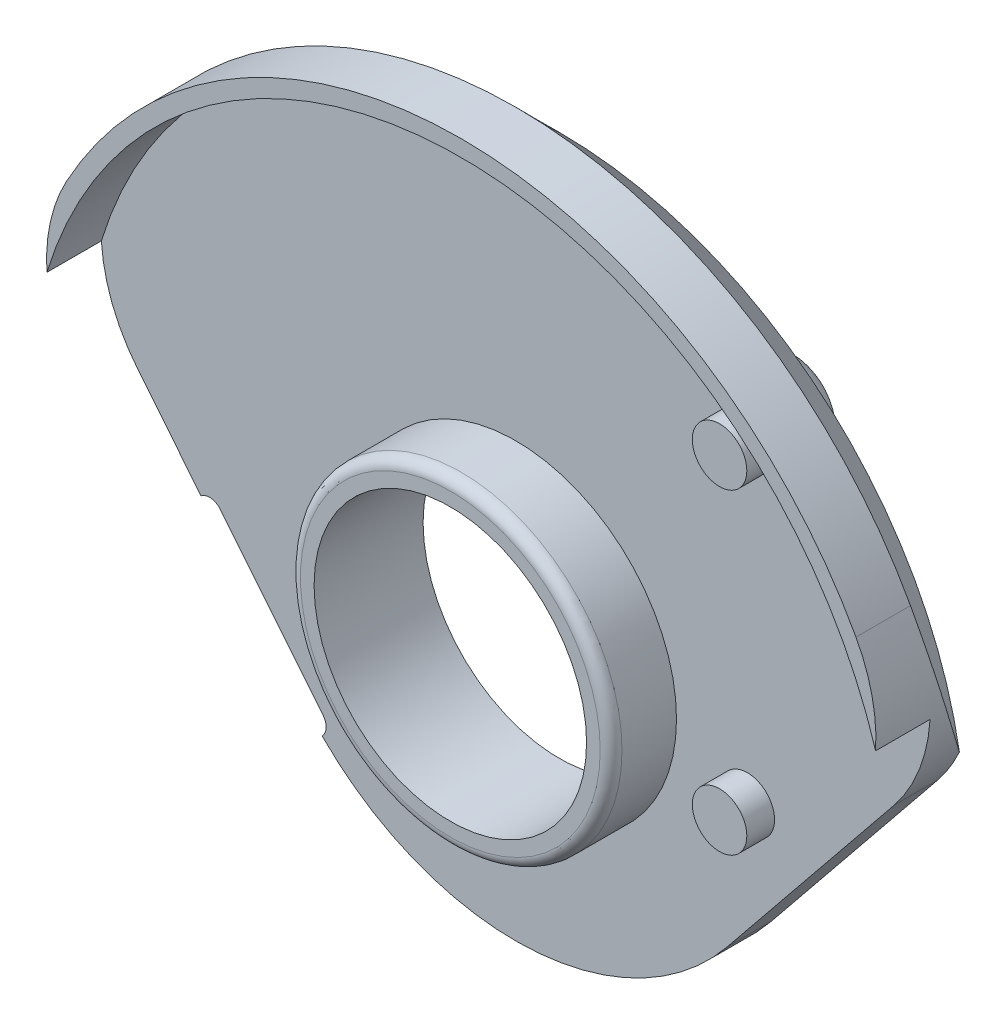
ISO-10303-21;
HEADER;
FILE_DESCRIPTION(('STEP AP214'),'2;1');
FILE_NAME('part.step','',(''),(''),'','','');
FILE_SCHEMA(('AUTOMOTIVE_DESIGN { 1 0 10303 214 1 1 1 1 }'));
ENDSEC;
DATA;
#1=APPLICATION_CONTEXT('core data for automotive mechanical design processes');
#2=APPLICATION_PROTOCOL_DEFINITION('international standard','automotive_design',2000,#1);
#3=PRODUCT_CONTEXT('',#1,'mechanical');
#4=PRODUCT('Part','Part','',(#3));
#5=PRODUCT_RELATED_PRODUCT_CATEGORY('part','',(#4));
#6=PRODUCT_DEFINITION_FORMATION('','',#4);
#7=PRODUCT_DEFINITION_CONTEXT('part definition',#1,'design');
#8=PRODUCT_DEFINITION('design','',#6,#7);
#9=PRODUCT_DEFINITION_SHAPE('','',#8);
#10=(LENGTH_UNIT() NAMED_UNIT(*) SI_UNIT(.MILLI.,.METRE.));
#11=(NAMED_UNIT(*) PLANE_ANGLE_UNIT() SI_UNIT($,.RADIAN.));
#12=(NAMED_UNIT(*) SI_UNIT($,.STERADIAN.) SOLID_ANGLE_UNIT());
#13=UNCERTAINTY_MEASURE_WITH_UNIT(LENGTH_MEASURE(1.E-05),#10,'distance_accuracy_value','');
#14=(GEOMETRIC_REPRESENTATION_CONTEXT(3) GLOBAL_UNCERTAINTY_ASSIGNED_CONTEXT((#13)) GLOBAL_UNIT_ASSIGNED_CONTEXT((#10,
#11,#12)) REPRESENTATION_CONTEXT('',''));
#15=CARTESIAN_POINT('',(0.,0.,0.));
#16=DIRECTION('',(0.,0.,1.));
#17=DIRECTION('',(1.,0.,0.));
#18=AXIS2_PLACEMENT_3D('',#15,#16,#17);
#19=CARTESIAN_POINT('',(3.,4.,-2.2));
#20=DIRECTION('',(0.,0.,1.));
#21=DIRECTION('',(1.,0.,0.));
#22=AXIS2_PLACEMENT_3D('',#19,#20,#21);
#23=PLANE('',#22);
#24=CARTESIAN_POINT('',(3.,4.,-2.2));
#25=DIRECTION('',(0.,0.,1.));
#26=DIRECTION('',(1.,0.,0.));
#27=AXIS2_PLACEMENT_3D('',#24,#25,#26);
#28=CIRCLE('',#27,0.46);
#29=CARTESIAN_POINT('',(3.46,4.,-2.2));
#30=VERTEX_POINT('',#29);
#31=EDGE_CURVE('E20',#30,#30,#28,.T.);
#32=ORIENTED_EDGE('',*,*,#31,.F.);
#33=EDGE_LOOP('',(#32));
#34=FACE_BOUND('',#33,.T.);
#35=ADVANCED_FACE('F16',(#34),#23,.F.);
#36=CARTESIAN_POINT('',(3.,4.,-1.7));
#37=DIRECTION('',(0.,0.,1.));
#38=DIRECTION('',(1.,0.,0.));
#39=AXIS2_PLACEMENT_3D('',#36,#37,#38);
#40=DEGENERATE_TOROIDAL_SURFACE('',#39,0.46,0.499999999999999,.T.);
#41=ORIENTED_EDGE('',*,*,#31,.T.);
#42=EDGE_LOOP('',(#41));
#43=FACE_BOUND('',#42,.T.);
#44=CARTESIAN_POINT('',(3.,4.,-1.7));
#45=DIRECTION('',(0.,0.,-1.));
#46=DIRECTION('',(-1.,0.,0.));
#47=AXIS2_PLACEMENT_3D('',#44,#45,#46);
#48=CIRCLE('',#47,0.96);
#49=CARTESIAN_POINT('',(2.04,4.,-1.7));
#50=VERTEX_POINT('',#49);
#51=EDGE_CURVE('E119',#50,#50,#48,.F.);
#52=ORIENTED_EDGE('',*,*,#51,.F.);
#53=EDGE_LOOP('',(#52));
#54=FACE_BOUND('',#53,.T.);
#55=ADVANCED_FACE('F18',(#43,#54),#40,.T.);
#56=CARTESIAN_POINT('',(3.,4.,0.));
#57=DIRECTION('',(0.,0.,-1.));
#58=DIRECTION('',(-1.,0.,0.));
#59=AXIS2_PLACEMENT_3D('',#56,#57,#58);
#60=CYLINDRICAL_SURFACE('',#59,0.96);
#61=ORIENTED_EDGE('',*,*,#51,.T.);
#62=EDGE_LOOP('',(#61));
#63=FACE_BOUND('',#62,.T.);
#64=CARTESIAN_POINT('',(3.,4.,-0.8));
#65=DIRECTION('',(0.,0.,-1.));
#66=DIRECTION('',(-1.,0.,0.));
#67=AXIS2_PLACEMENT_3D('',#64,#65,#66);
#68=CIRCLE('',#67,0.96);
#69=CARTESIAN_POINT('',(2.04,4.,-0.8));
#70=VERTEX_POINT('',#69);
#71=EDGE_CURVE('E139',#70,#70,#68,.T.);
#72=ORIENTED_EDGE('',*,*,#71,.T.);
#73=EDGE_LOOP('',(#72));
#74=FACE_BOUND('',#73,.T.);
#75=ADVANCED_FACE('F333',(#63,#74),#60,.T.);
#76=CARTESIAN_POINT('',(0.,0.,0.));
#77=DIRECTION('',(0.,0.,-1.));
#78=DIRECTION('',(-1.,0.,0.));
#79=AXIS2_PLACEMENT_3D('',#76,#77,#78);
#80=CYLINDRICAL_SURFACE('',#79,2.5);
#81=CARTESIAN_POINT('',(0.,0.,-0.8));
#82=DIRECTION('',(0.,0.,-1.));
#83=DIRECTION('',(-1.,0.,0.));
#84=AXIS2_PLACEMENT_3D('',#81,#82,#83);
#85=CIRCLE('',#84,2.5);
#86=CARTESIAN_POINT('',(-2.5,0.,-0.8));
#87=VERTEX_POINT('',#86);
#88=EDGE_CURVE('E142',#87,#87,#85,.T.);
#89=ORIENTED_EDGE('',*,*,#88,.T.);
#90=EDGE_LOOP('',(#89));
#91=FACE_BOUND('',#90,.T.);
#92=CARTESIAN_POINT('',(0.,0.,1.2));
#93=DIRECTION('',(0.,0.,-1.));
#94=DIRECTION('',(-1.,0.,0.));
#95=AXIS2_PLACEMENT_3D('',#92,#93,#94);
#96=CIRCLE('',#95,2.5);
#97=CARTESIAN_POINT('',(-2.5,0.,1.2));
#98=VERTEX_POINT('',#97);
#99=EDGE_CURVE('E132',#98,#98,#96,.F.);
#100=ORIENTED_EDGE('',*,*,#99,.T.);
#101=EDGE_LOOP('',(#100));
#102=FACE_BOUND('',#101,.T.);
#103=ADVANCED_FACE('F330',(#91,#102),#80,.F.);
#104=CARTESIAN_POINT('',(0.,0.,0.));
#105=DIRECTION('',(0.,0.,-1.));
#106=DIRECTION('',(-1.,0.,0.));
#107=AXIS2_PLACEMENT_3D('',#104,#105,#106);
#108=CYLINDRICAL_SURFACE('',#107,8.25);
#109=CARTESIAN_POINT('',(0.,0.,1.));
#110=DIRECTION('',(0.,0.,-1.));
#111=DIRECTION('',(-1.,0.,0.));
#112=AXIS2_PLACEMENT_3D('',#109,#110,#111);
#113=CIRCLE('',#112,8.25);
#114=CARTESIAN_POINT('',(7.24285548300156,3.95013220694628,1.));
#115=VERTEX_POINT('',#114);
#116=CARTESIAN_POINT('',(-7.24285548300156,3.95013220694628,1.));
#117=VERTEX_POINT('',#116);
#118=EDGE_CURVE('E112',#115,#117,#113,.F.);
#119=ORIENTED_EDGE('',*,*,#118,.F.);
#120=DIRECTION('',(0.,0.,-1.));
#121=VECTOR('',#120,1.);
#122=CARTESIAN_POINT('',(7.24285548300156,3.95013220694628,0.));
#123=LINE('',#122,#121);
#124=CARTESIAN_POINT('',(7.24285548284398,3.95013220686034,5.38471498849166E-10));
#125=VERTEX_POINT('',#124);
#126=EDGE_CURVE('E103',#115,#125,#123,.T.);
#127=ORIENTED_EDGE('',*,*,#126,.T.);
#128=CARTESIAN_POINT('',(0.,0.,3.58981941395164E-10));
#129=DIRECTION('',(0.,0.,1.));
#130=DIRECTION('',(0.,1.,0.));
#131=AXIS2_PLACEMENT_3D('',#128,#129,#130);
#132=CIRCLE('',#131,8.24999999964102);
#133=CARTESIAN_POINT('',(-7.24285548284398,3.95013220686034,5.38471498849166E-10));
#134=VERTEX_POINT('',#133);
#135=EDGE_CURVE('E115',#134,#125,#132,.F.);
#136=ORIENTED_EDGE('',*,*,#135,.F.);
#137=DIRECTION('',(0.,0.,-1.));
#138=VECTOR('',#137,1.);
#139=CARTESIAN_POINT('',(-7.24285548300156,3.95013220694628,0.));
#140=LINE('',#139,#138);
#141=EDGE_CURVE('E108',#134,#117,#140,.F.);
#142=ORIENTED_EDGE('',*,*,#141,.T.);
#143=EDGE_LOOP('',(#119,#127,#136,#142));
#144=FACE_BOUND('',#143,.T.);
#145=ADVANCED_FACE('F110',(#144),#108,.T.);
#146=CARTESIAN_POINT('',(0.,0.,1.2));
#147=DIRECTION('',(0.,0.,-1.));
#148=DIRECTION('',(-1.,0.,0.));
#149=AXIS2_PLACEMENT_3D('',#146,#147,#148);
#150=PLANE('',#149);
#151=ORIENTED_EDGE('',*,*,#99,.F.);
#152=EDGE_LOOP('',(#151));
#153=FACE_BOUND('',#152,.T.);
#154=CARTESIAN_POINT('',(0.,0.,1.2));
#155=DIRECTION('',(0.,0.,-1.));
#156=DIRECTION('',(1.,0.,0.));
#157=AXIS2_PLACEMENT_3D('',#154,#155,#156);
#158=CIRCLE('',#157,2.75);
#159=CARTESIAN_POINT('',(2.75,0.,1.2));
#160=VERTEX_POINT('',#159);
#161=EDGE_CURVE('E150',#160,#160,#158,.T.);
#162=ORIENTED_EDGE('',*,*,#161,.F.);
#163=EDGE_LOOP('',(#162));
#164=FACE_BOUND('',#163,.T.);
#165=ADVANCED_FACE('F318',(#153,#164),#150,.F.);
#166=CARTESIAN_POINT('',(0.,5.77962089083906,1.));
#167=DIRECTION('',(0.,0.,1.));
#168=DIRECTION('',(1.,0.,0.));
#169=AXIS2_PLACEMENT_3D('',#166,#167,#168);
#170=PLANE('',#169);
#171=CARTESIAN_POINT('',(0.,0.,1.));
#172=DIRECTION('',(0.,0.,1.));
#173=DIRECTION('',(1.,0.,0.));
#174=AXIS2_PLACEMENT_3D('',#171,#172,#173);
#175=CIRCLE('',#174,7.95);
#176=CARTESIAN_POINT('',(-7.60302402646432,2.32304232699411,1.));
#177=VERTEX_POINT('',#176);
#178=CARTESIAN_POINT('',(7.60302402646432,2.32304232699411,1.));
#179=VERTEX_POINT('',#178);
#180=EDGE_CURVE('E147',#177,#179,#175,.F.);
#181=ORIENTED_EDGE('',*,*,#180,.T.);
#182=CARTESIAN_POINT('',(4.60908985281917,2.51372049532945,1.));
#183=DIRECTION('',(0.,0.,-1.));
#184=DIRECTION('',(-1.,0.,0.));
#185=AXIS2_PLACEMENT_3D('',#182,#183,#184);
#186=CIRCLE('',#185,3.);
#187=EDGE_CURVE('E129',#179,#115,#186,.F.);
#188=ORIENTED_EDGE('',*,*,#187,.T.);
#189=ORIENTED_EDGE('',*,*,#118,.T.);
#190=CARTESIAN_POINT('',(-4.60908985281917,2.51372049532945,1.));
#191=DIRECTION('',(0.,0.,-1.));
#192=DIRECTION('',(-1.,0.,0.));
#193=AXIS2_PLACEMENT_3D('',#190,#191,#192);
#194=CIRCLE('',#193,3.);
#195=EDGE_CURVE('E122',#117,#177,#194,.F.);
#196=ORIENTED_EDGE('',*,*,#195,.T.);
#197=EDGE_LOOP('',(#181,#188,#189,#196));
#198=FACE_BOUND('',#197,.T.);
#199=ADVANCED_FACE('F131',(#198),#170,.T.);
#200=CARTESIAN_POINT('',(0.,5.77962089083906,-0.8));
#201=DIRECTION('',(0.,0.,1.));
#202=DIRECTION('',(1.,0.,0.));
#203=AXIS2_PLACEMENT_3D('',#200,#201,#202);
#204=PLANE('',#203);
#205=ORIENTED_EDGE('',*,*,#88,.F.);
#206=EDGE_LOOP('',(#205));
#207=FACE_BOUND('',#206,.T.);
#208=ORIENTED_EDGE('',*,*,#71,.F.);
#209=EDGE_LOOP('',(#208));
#210=FACE_BOUND('',#209,.T.);
#211=CARTESIAN_POINT('',(4.60908985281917,2.51372049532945,-0.8));
#212=DIRECTION('',(0.,0.,-1.));
#213=DIRECTION('',(-1.,0.,0.));
#214=AXIS2_PLACEMENT_3D('',#211,#212,#213);
#215=CIRCLE('',#214,3.);
#216=CARTESIAN_POINT('',(6.94052773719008,0.625759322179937,-0.8));
#217=VERTEX_POINT('',#216);
#218=CARTESIAN_POINT('',(7.34045278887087,1.27289153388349,-0.80000000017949));
#219=VERTEX_POINT('',#218);
#220=EDGE_CURVE('E137',#217,#219,#215,.F.);
#221=ORIENTED_EDGE('',*,*,#220,.F.);
#222=DIRECTION('',(0.629320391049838,0.77714596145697,0.));
#223=VECTOR('',#222,1.);
#224=CARTESIAN_POINT('',(3.88572980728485,-3.14660195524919,-0.8));
#225=LINE('',#224,#223);
#226=CARTESIAN_POINT('',(3.88572980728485,-3.14660195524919,-0.8));
#227=VERTEX_POINT('',#226);
#228=EDGE_CURVE('E302',#227,#217,#225,.T.);
#229=ORIENTED_EDGE('',*,*,#228,.F.);
#230=CARTESIAN_POINT('',(0.,0.,-0.8));
#231=DIRECTION('',(0.,0.,-1.));
#232=DIRECTION('',(-1.,0.,0.));
#233=AXIS2_PLACEMENT_3D('',#230,#231,#232);
#234=CIRCLE('',#233,5.);
#235=CARTESIAN_POINT('',(-3.55247410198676,-3.51851215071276,-0.8));
#236=VERTEX_POINT('',#235);
#237=EDGE_CURVE('E185',#236,#227,#234,.F.);
#238=ORIENTED_EDGE('',*,*,#237,.F.);
#239=CARTESIAN_POINT('',(-3.7283997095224,-3.34088844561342,-0.8));
#240=DIRECTION('',(0.,0.,-1.));
#241=DIRECTION('',(-1.,0.,0.));
#242=AXIS2_PLACEMENT_3D('',#239,#240,#241);
#243=CIRCLE('',#242,0.250000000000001);
#244=CARTESIAN_POINT('',(-3.53411321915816,-3.18355834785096,-0.8));
#245=VERTEX_POINT('',#244);
#246=EDGE_CURVE('E369',#236,#245,#243,.F.);
#247=ORIENTED_EDGE('',*,*,#246,.T.);
#248=DIRECTION('',(0.629320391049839,-0.77714596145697,0.));
#249=VECTOR('',#248,1.);
#250=CARTESIAN_POINT('',(-5.4228031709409,-0.851220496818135,-0.8));
#251=LINE('',#250,#249);
#252=CARTESIAN_POINT('',(-5.4228031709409,-0.851220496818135,-0.8));
#253=VERTEX_POINT('',#252);
#254=EDGE_CURVE('E306',#253,#245,#251,.T.);
#255=ORIENTED_EDGE('',*,*,#254,.F.);
#256=CARTESIAN_POINT('',(-5.61708966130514,-1.0085505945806,-0.8));
#257=DIRECTION('',(0.,0.,-1.));
#258=DIRECTION('',(-1.,0.,0.));
#259=AXIS2_PLACEMENT_3D('',#256,#257,#258);
#260=CIRCLE('',#259,0.250000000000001);
#261=CARTESIAN_POINT('',(-5.7744197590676,-0.814264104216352,-0.8));
#262=VERTEX_POINT('',#261);
#263=EDGE_CURVE('E309',#253,#262,#260,.F.);
#264=ORIENTED_EDGE('',*,*,#263,.T.);
#265=DIRECTION('',(0.629320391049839,-0.77714596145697,0.));
#266=VECTOR('',#265,1.);
#267=CARTESIAN_POINT('',(-6.94052773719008,0.625759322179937,-0.8));
#268=LINE('',#267,#266);
#269=CARTESIAN_POINT('',(-6.94052773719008,0.625759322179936,-0.8));
#270=VERTEX_POINT('',#269);
#271=EDGE_CURVE('E310',#270,#262,#268,.T.);
#272=ORIENTED_EDGE('',*,*,#271,.F.);
#273=CARTESIAN_POINT('',(-4.60908985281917,2.51372049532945,-0.8));
#274=DIRECTION('',(0.,0.,-1.));
#275=DIRECTION('',(-1.,0.,0.));
#276=AXIS2_PLACEMENT_3D('',#273,#274,#275);
#277=CIRCLE('',#276,3.);
#278=CARTESIAN_POINT('',(-7.34045278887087,1.27289153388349,-0.80000000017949));
#279=VERTEX_POINT('',#278);
#280=EDGE_CURVE('E157',#279,#270,#277,.F.);
#281=ORIENTED_EDGE('',*,*,#280,.F.);
#282=CARTESIAN_POINT('',(0.,0.,-0.80000000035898));
#283=DIRECTION('',(0.,0.,1.));
#284=DIRECTION('',(1.,0.,0.));
#285=AXIS2_PLACEMENT_3D('',#282,#283,#284);
#286=CIRCLE('',#285,7.45000000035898);
#287=EDGE_CURVE('E145',#219,#279,#286,.T.);
#288=ORIENTED_EDGE('',*,*,#287,.F.);
#289=EDGE_LOOP('',(#221,#229,#238,#247,#255,#264,#272,#281,#288));
#290=FACE_BOUND('',#289,.T.);
#291=ADVANCED_FACE('F168',(#207,#210,#290),#204,.F.);
#292=CARTESIAN_POINT('',(0.,0.,3.58982537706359E-10));
#293=DIRECTION('',(0.,0.,1.));
#294=DIRECTION('',(1.,0.,0.));
#295=AXIS2_PLACEMENT_3D('',#292,#293,#294);
#296=CONICAL_SURFACE('',#295,8.24999999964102,0.7853981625);
#297=CARTESIAN_POINT('',(-7.24285548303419,3.95013220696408,7.02562395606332E-10));
#298=CARTESIAN_POINT('',(-7.27853072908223,3.88474691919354,6.14051450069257E-06));
#299=CARTESIAN_POINT('',(-7.31174406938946,3.81802712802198,-0.00176509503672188));
#300=CARTESIAN_POINT('',(-7.37305561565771,3.6824820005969,-0.00881469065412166));
#301=CARTESIAN_POINT('',(-7.40115548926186,3.61365735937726,-0.0140919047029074));
#302=CARTESIAN_POINT('',(-7.45195727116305,3.47473718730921,-0.0280742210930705));
#303=CARTESIAN_POINT('',(-7.47468300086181,3.40464880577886,-0.0367637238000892));
#304=CARTESIAN_POINT('',(-7.51482072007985,3.26346860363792,-0.0574747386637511));
#305=CARTESIAN_POINT('',(-7.53223249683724,3.19237674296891,-0.0694963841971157));
#306=CARTESIAN_POINT('',(-7.57642183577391,2.9785361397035,-0.110375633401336));
#307=CARTESIAN_POINT('',(-7.59524489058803,2.83496923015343,-0.144073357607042));
#308=CARTESIAN_POINT('',(-7.61228210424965,2.54984997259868,-0.223191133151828));
#309=CARTESIAN_POINT('',(-7.61047339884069,2.40830003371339,-0.268624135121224));
#310=CARTESIAN_POINT('',(-7.58721001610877,2.12357645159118,-0.37238966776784));
#311=CARTESIAN_POINT('',(-7.56476969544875,1.98068058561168,-0.431256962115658));
#312=CARTESIAN_POINT('',(-7.50120597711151,1.70389692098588,-0.55875482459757));
#313=CARTESIAN_POINT('',(-7.46009771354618,1.57000192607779,-0.6273774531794));
#314=CARTESIAN_POINT('',(-7.38903083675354,1.38424196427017,-0.732608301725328));
#315=CARTESIAN_POINT('',(-7.36548218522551,1.3279692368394,-0.765929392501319));
#316=CARTESIAN_POINT('',(-7.34045278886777,1.27289153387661,-0.800000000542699));
#317=B_SPLINE_CURVE_WITH_KNOTS('',3,(#297,#298,#299,#300,#301,#302,#303,#304,#305,#306,#307,
#308,#309,#310,#311,#312,#313,#314,#315,#316),.UNSPECIFIED.,.F.,.F.,(4,2,2,2,2,2,2,2,2,4),(0.,
0.223368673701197,0.446664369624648,0.66895091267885,0.891246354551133,1.33503643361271,
1.77931837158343,2.24599396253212,2.71229189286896,2.92066672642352),.UNSPECIFIED.);
#318=EDGE_CURVE('E149',#134,#279,#317,.T.);
#319=ORIENTED_EDGE('',*,*,#318,.F.);
#320=ORIENTED_EDGE('',*,*,#135,.T.);
#321=CARTESIAN_POINT('',(7.34045278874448,1.27289153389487,-0.80000000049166));
#322=CARTESIAN_POINT('',(7.37202516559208,1.3423767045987,-0.757020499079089));
#323=CARTESIAN_POINT('',(7.40122962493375,1.41371842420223,-0.715254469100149));
#324=CARTESIAN_POINT('',(7.4544624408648,1.55983494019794,-0.63437898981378));
#325=CARTESIAN_POINT('',(7.47848677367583,1.63461235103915,-0.59527162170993));
#326=CARTESIAN_POINT('',(7.52100528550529,1.78770317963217,-0.519768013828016));
#327=CARTESIAN_POINT('',(7.5394628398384,1.86603627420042,-0.483390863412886));
#328=CARTESIAN_POINT('',(7.57017857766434,2.0253242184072,-0.413918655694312));
#329=CARTESIAN_POINT('',(7.58243763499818,2.10627869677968,-0.380823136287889));
#330=CARTESIAN_POINT('',(7.60038753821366,2.27077419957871,-0.318013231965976));
#331=CARTESIAN_POINT('',(7.60603870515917,2.35432778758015,-0.288320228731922));
#332=CARTESIAN_POINT('',(7.610259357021,2.52285947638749,-0.232859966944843));
#333=CARTESIAN_POINT('',(7.60883284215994,2.60783674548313,-0.20709049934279));
#334=CARTESIAN_POINT('',(7.59862274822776,2.77817717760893,-0.15984248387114));
#335=CARTESIAN_POINT('',(7.58986950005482,2.86353730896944,-0.138346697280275));
#336=CARTESIAN_POINT('',(7.56486790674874,3.03412357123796,-0.0997816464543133));
#337=CARTESIAN_POINT('',(7.54862091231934,3.11934972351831,-0.0827115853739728));
#338=CARTESIAN_POINT('',(7.49820509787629,3.33246650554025,-0.0456358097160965));
#339=CARTESIAN_POINT('',(7.45911737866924,3.45978960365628,-0.0286247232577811));
#340=CARTESIAN_POINT('',(7.3876576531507,3.64689341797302,-0.0115034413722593));
#341=CARTESIAN_POINT('',(7.36159653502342,3.7088045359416,-0.00719539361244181));
#342=CARTESIAN_POINT('',(7.30531354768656,3.83087395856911,-0.00144313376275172));
#343=CARTESIAN_POINT('',(7.27508994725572,3.8910315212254,-1.17140153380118E-07));
#344=CARTESIAN_POINT('',(7.24285548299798,3.95013220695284,7.17960142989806E-10));
#345=B_SPLINE_CURVE_WITH_KNOTS('',3,(#321,#322,#323,#324,#325,#326,#327,#328,#329,#330,#331,
#332,#333,#334,#335,#336,#337,#338,#339,#340,#341,#342,#343,#344),.UNSPECIFIED.,.F.,.F.,(4,2,2,
2,2,2,2,2,2,2,2,4),(0.,0.262749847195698,0.525703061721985,0.790350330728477,1.05496028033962,
1.32115112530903,1.58719153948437,1.8521360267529,2.11703277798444,2.5179724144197,
2.71972517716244,2.92156210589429),.UNSPECIFIED.);
#346=EDGE_CURVE('E174',#219,#125,#345,.T.);
#347=ORIENTED_EDGE('',*,*,#346,.F.);
#348=ORIENTED_EDGE('',*,*,#287,.T.);
#349=EDGE_LOOP('',(#319,#320,#347,#348));
#350=FACE_BOUND('',#349,.T.);
#351=ADVANCED_FACE('F162',(#350),#296,.T.);
#352=CARTESIAN_POINT('',(4.25,5.1,0.51));
#353=DIRECTION('',(0.,0.,-1.));
#354=DIRECTION('',(-1.,0.,0.));
#355=AXIS2_PLACEMENT_3D('',#352,#353,#354);
#356=PLANE('',#355);
#357=CARTESIAN_POINT('',(4.25,5.1,0.51));
#358=DIRECTION('',(0.,0.,1.));
#359=DIRECTION('',(1.,0.,0.));
#360=AXIS2_PLACEMENT_3D('',#357,#358,#359);
#361=CIRCLE('',#360,0.5);
#362=CARTESIAN_POINT('',(4.75,5.1,0.51));
#363=VERTEX_POINT('',#362);
#364=EDGE_CURVE('E183',#363,#363,#361,.F.);
#365=ORIENTED_EDGE('',*,*,#364,.F.);
#366=EDGE_LOOP('',(#365));
#367=FACE_BOUND('',#366,.T.);
#368=ADVANCED_FACE('F167',(#367),#356,.F.);
#369=CARTESIAN_POINT('',(4.25,-0.7,0.51));
#370=DIRECTION('',(0.,0.,-1.));
#371=DIRECTION('',(-1.,0.,0.));
#372=AXIS2_PLACEMENT_3D('',#369,#370,#371);
#373=PLANE('',#372);
#374=CARTESIAN_POINT('',(4.25,-0.7,0.51));
#375=DIRECTION('',(0.,0.,1.));
#376=DIRECTION('',(1.,0.,0.));
#377=AXIS2_PLACEMENT_3D('',#374,#375,#376);
#378=CIRCLE('',#377,0.5);
#379=CARTESIAN_POINT('',(4.75,-0.7,0.51));
#380=VERTEX_POINT('',#379);
#381=EDGE_CURVE('E244',#380,#380,#378,.F.);
#382=ORIENTED_EDGE('',*,*,#381,.F.);
#383=EDGE_LOOP('',(#382));
#384=FACE_BOUND('',#383,.T.);
#385=ADVANCED_FACE('F296',(#384),#373,.F.);
#386=CARTESIAN_POINT('',(0.,0.,1.));
#387=DIRECTION('',(0.,0.,-1.));
#388=DIRECTION('',(-1.,0.,0.));
#389=AXIS2_PLACEMENT_3D('',#386,#387,#388);
#390=TOROIDAL_SURFACE('',#389,2.75,0.2);
#391=CARTESIAN_POINT('',(0.,0.,1.));
#392=DIRECTION('',(0.,0.,1.));
#393=DIRECTION('',(1.,0.,0.));
#394=AXIS2_PLACEMENT_3D('',#391,#392,#393);
#395=CIRCLE('',#394,2.95);
#396=CARTESIAN_POINT('',(2.95,0.,1.));
#397=VERTEX_POINT('',#396);
#398=EDGE_CURVE('E246',#397,#397,#395,.F.);
#399=ORIENTED_EDGE('',*,*,#398,.F.);
#400=EDGE_LOOP('',(#399));
#401=FACE_BOUND('',#400,.T.);
#402=ORIENTED_EDGE('',*,*,#161,.T.);
#403=EDGE_LOOP('',(#402));
#404=FACE_BOUND('',#403,.T.);
#405=ADVANCED_FACE('F287',(#401,#404),#390,.T.);
#406=CARTESIAN_POINT('',(0.,0.,0.));
#407=DIRECTION('',(0.,0.,1.));
#408=DIRECTION('',(1.,0.,0.));
#409=AXIS2_PLACEMENT_3D('',#406,#407,#408);
#410=CYLINDRICAL_SURFACE('',#409,7.95);
#411=DIRECTION('',(0.,0.,-1.));
#412=VECTOR('',#411,1.);
#413=CARTESIAN_POINT('',(-7.60302402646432,2.32304232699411,0.));
#414=LINE('',#413,#412);
#415=CARTESIAN_POINT('',(-7.60302402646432,2.32304232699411,0.));
#416=VERTEX_POINT('',#415);
#417=EDGE_CURVE('E125',#416,#177,#414,.F.);
#418=ORIENTED_EDGE('',*,*,#417,.F.);
#419=CARTESIAN_POINT('',(0.,0.,0.));
#420=DIRECTION('',(0.,0.,1.));
#421=DIRECTION('',(1.,0.,0.));
#422=AXIS2_PLACEMENT_3D('',#419,#420,#421);
#423=CIRCLE('',#422,7.95);
#424=CARTESIAN_POINT('',(7.60302402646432,2.32304232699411,0.));
#425=VERTEX_POINT('',#424);
#426=EDGE_CURVE('E248',#425,#416,#423,.T.);
#427=ORIENTED_EDGE('',*,*,#426,.F.);
#428=DIRECTION('',(0.,0.,-1.));
#429=VECTOR('',#428,1.);
#430=CARTESIAN_POINT('',(7.60302402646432,2.32304232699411,0.));
#431=LINE('',#430,#429);
#432=EDGE_CURVE('E181',#179,#425,#431,.T.);
#433=ORIENTED_EDGE('',*,*,#432,.F.);
#434=ORIENTED_EDGE('',*,*,#180,.F.);
#435=EDGE_LOOP('',(#418,#427,#433,#434));
#436=FACE_BOUND('',#435,.T.);
#437=ADVANCED_FACE('F219',(#436),#410,.F.);
#438=CARTESIAN_POINT('',(-4.60908985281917,2.51372049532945,0.));
#439=DIRECTION('',(0.,0.,-1.));
#440=DIRECTION('',(-1.,0.,0.));
#441=AXIS2_PLACEMENT_3D('',#438,#439,#440);
#442=CYLINDRICAL_SURFACE('',#441,3.);
#443=ORIENTED_EDGE('',*,*,#195,.F.);
#444=ORIENTED_EDGE('',*,*,#141,.F.);
#445=ORIENTED_EDGE('',*,*,#318,.T.);
#446=ORIENTED_EDGE('',*,*,#280,.T.);
#447=DIRECTION('',(0.,0.,1.));
#448=VECTOR('',#447,1.);
#449=CARTESIAN_POINT('',(-6.94052773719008,0.625759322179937,0.));
#450=LINE('',#449,#448);
#451=CARTESIAN_POINT('',(-6.94052773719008,0.625759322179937,0.));
#452=VERTEX_POINT('',#451);
#453=EDGE_CURVE('E312',#452,#270,#450,.F.);
#454=ORIENTED_EDGE('',*,*,#453,.F.);
#455=CARTESIAN_POINT('',(-4.60908985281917,2.51372049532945,0.));
#456=DIRECTION('',(0.,0.,-1.));
#457=DIRECTION('',(-1.,0.,0.));
#458=AXIS2_PLACEMENT_3D('',#455,#456,#457);
#459=CIRCLE('',#458,3.);
#460=EDGE_CURVE('E254',#416,#452,#459,.F.);
#461=ORIENTED_EDGE('',*,*,#460,.F.);
#462=ORIENTED_EDGE('',*,*,#417,.T.);
#463=EDGE_LOOP('',(#443,#444,#445,#446,#454,#461,#462));
#464=FACE_BOUND('',#463,.T.);
#465=ADVANCED_FACE('F123',(#464),#442,.T.);
#466=CARTESIAN_POINT('',(-6.94052773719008,0.625759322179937,0.));
#467=DIRECTION('',(-0.77714596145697,-0.629320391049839,0.));
#468=DIRECTION('',(0.629320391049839,-0.77714596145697,0.));
#469=AXIS2_PLACEMENT_3D('',#466,#467,#468);
#470=PLANE('',#469);
#471=DIRECTION('',(0.629320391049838,-0.77714596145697,0.));
#472=VECTOR('',#471,1.);
#473=CARTESIAN_POINT('',(-6.94052773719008,0.625759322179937,0.));
#474=LINE('',#473,#472);
#475=CARTESIAN_POINT('',(-5.7744197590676,-0.814264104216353,0.));
#476=VERTEX_POINT('',#475);
#477=EDGE_CURVE('E257',#452,#476,#474,.T.);
#478=ORIENTED_EDGE('',*,*,#477,.F.);
#479=ORIENTED_EDGE('',*,*,#453,.T.);
#480=ORIENTED_EDGE('',*,*,#271,.T.);
#481=DIRECTION('',(0.,0.,-1.));
#482=VECTOR('',#481,1.);
#483=CARTESIAN_POINT('',(-5.7744197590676,-0.814264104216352,0.));
#484=LINE('',#483,#482);
#485=EDGE_CURVE('E372',#262,#476,#484,.F.);
#486=ORIENTED_EDGE('',*,*,#485,.T.);
#487=EDGE_LOOP('',(#478,#479,#480,#486));
#488=FACE_BOUND('',#487,.T.);
#489=ADVANCED_FACE('F211',(#488),#470,.T.);
#490=CARTESIAN_POINT('',(-5.61708966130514,-1.0085505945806,0.));
#491=DIRECTION('',(0.,0.,-1.));
#492=DIRECTION('',(-1.,0.,0.));
#493=AXIS2_PLACEMENT_3D('',#490,#491,#492);
#494=CYLINDRICAL_SURFACE('',#493,0.250000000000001);
#495=DIRECTION('',(0.,0.,1.));
#496=VECTOR('',#495,1.);
#497=CARTESIAN_POINT('',(-5.4228031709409,-0.851220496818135,0.));
#498=LINE('',#497,#496);
#499=CARTESIAN_POINT('',(-5.4228031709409,-0.851220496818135,0.));
#500=VERTEX_POINT('',#499);
#501=EDGE_CURVE('E308',#500,#253,#498,.F.);
#502=ORIENTED_EDGE('',*,*,#501,.F.);
#503=CARTESIAN_POINT('',(-5.61708966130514,-1.0085505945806,0.));
#504=DIRECTION('',(0.,0.,-1.));
#505=DIRECTION('',(-1.,0.,0.));
#506=AXIS2_PLACEMENT_3D('',#503,#504,#505);
#507=CIRCLE('',#506,0.250000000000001);
#508=EDGE_CURVE('E258',#476,#500,#507,.T.);
#509=ORIENTED_EDGE('',*,*,#508,.F.);
#510=ORIENTED_EDGE('',*,*,#485,.F.);
#511=ORIENTED_EDGE('',*,*,#263,.F.);
#512=EDGE_LOOP('',(#502,#509,#510,#511));
#513=FACE_BOUND('',#512,.T.);
#514=ADVANCED_FACE('F208',(#513),#494,.F.);
#515=CARTESIAN_POINT('',(-5.4228031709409,-0.851220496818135,0.));
#516=DIRECTION('',(-0.77714596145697,-0.629320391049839,0.));
#517=DIRECTION('',(0.629320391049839,-0.77714596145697,0.));
#518=AXIS2_PLACEMENT_3D('',#515,#516,#517);
#519=PLANE('',#518);
#520=DIRECTION('',(0.629320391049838,-0.77714596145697,0.));
#521=VECTOR('',#520,1.);
#522=CARTESIAN_POINT('',(-5.4228031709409,-0.851220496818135,0.));
#523=LINE('',#522,#521);
#524=CARTESIAN_POINT('',(-3.53411321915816,-3.18355834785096,0.));
#525=VERTEX_POINT('',#524);
#526=EDGE_CURVE('E261',#500,#525,#523,.T.);
#527=ORIENTED_EDGE('',*,*,#526,.F.);
#528=ORIENTED_EDGE('',*,*,#501,.T.);
#529=ORIENTED_EDGE('',*,*,#254,.T.);
#530=DIRECTION('',(0.,0.,-1.));
#531=VECTOR('',#530,1.);
#532=CARTESIAN_POINT('',(-3.53411321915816,-3.18355834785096,0.));
#533=LINE('',#532,#531);
#534=EDGE_CURVE('E367',#245,#525,#533,.F.);
#535=ORIENTED_EDGE('',*,*,#534,.T.);
#536=EDGE_LOOP('',(#527,#528,#529,#535));
#537=FACE_BOUND('',#536,.T.);
#538=ADVANCED_FACE('F204',(#537),#519,.T.);
#539=CARTESIAN_POINT('',(-3.7283997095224,-3.34088844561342,0.));
#540=DIRECTION('',(0.,0.,-1.));
#541=DIRECTION('',(-1.,0.,0.));
#542=AXIS2_PLACEMENT_3D('',#539,#540,#541);
#543=CYLINDRICAL_SURFACE('',#542,0.250000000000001);
#544=DIRECTION('',(0.,0.,-1.));
#545=VECTOR('',#544,1.);
#546=CARTESIAN_POINT('',(-3.55247410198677,-3.51851215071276,0.));
#547=LINE('',#546,#545);
#548=CARTESIAN_POINT('',(-3.55247410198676,-3.51851215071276,0.));
#549=VERTEX_POINT('',#548);
#550=EDGE_CURVE('E304',#549,#236,#547,.T.);
#551=ORIENTED_EDGE('',*,*,#550,.F.);
#552=CARTESIAN_POINT('',(-3.7283997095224,-3.34088844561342,0.));
#553=DIRECTION('',(0.,0.,-1.));
#554=DIRECTION('',(-1.,0.,0.));
#555=AXIS2_PLACEMENT_3D('',#552,#553,#554);
#556=CIRCLE('',#555,0.250000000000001);
#557=EDGE_CURVE('E262',#525,#549,#556,.T.);
#558=ORIENTED_EDGE('',*,*,#557,.F.);
#559=ORIENTED_EDGE('',*,*,#534,.F.);
#560=ORIENTED_EDGE('',*,*,#246,.F.);
#561=EDGE_LOOP('',(#551,#558,#559,#560));
#562=FACE_BOUND('',#561,.T.);
#563=ADVANCED_FACE('F200',(#562),#543,.F.);
#564=CARTESIAN_POINT('',(0.,0.,0.));
#565=DIRECTION('',(0.,0.,-1.));
#566=DIRECTION('',(-1.,0.,0.));
#567=AXIS2_PLACEMENT_3D('',#564,#565,#566);
#568=CYLINDRICAL_SURFACE('',#567,5.);
#569=CARTESIAN_POINT('',(0.,0.,0.));
#570=DIRECTION('',(0.,0.,-1.));
#571=DIRECTION('',(-1.,0.,0.));
#572=AXIS2_PLACEMENT_3D('',#569,#570,#571);
#573=CIRCLE('',#572,5.);
#574=CARTESIAN_POINT('',(3.88572980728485,-3.14660195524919,0.));
#575=VERTEX_POINT('',#574);
#576=EDGE_CURVE('E265',#549,#575,#573,.F.);
#577=ORIENTED_EDGE('',*,*,#576,.F.);
#578=ORIENTED_EDGE('',*,*,#550,.T.);
#579=ORIENTED_EDGE('',*,*,#237,.T.);
#580=DIRECTION('',(0.,0.,1.));
#581=VECTOR('',#580,1.);
#582=CARTESIAN_POINT('',(3.88572980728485,-3.14660195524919,0.));
#583=LINE('',#582,#581);
#584=EDGE_CURVE('E182',#575,#227,#583,.F.);
#585=ORIENTED_EDGE('',*,*,#584,.F.);
#586=EDGE_LOOP('',(#577,#578,#579,#585));
#587=FACE_BOUND('',#586,.T.);
#588=ADVANCED_FACE('F197',(#587),#568,.T.);
#589=CARTESIAN_POINT('',(3.88572980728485,-3.14660195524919,0.));
#590=DIRECTION('',(0.77714596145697,-0.629320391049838,0.));
#591=DIRECTION('',(0.629320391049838,0.77714596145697,0.));
#592=AXIS2_PLACEMENT_3D('',#589,#590,#591);
#593=PLANE('',#592);
#594=DIRECTION('',(0.629320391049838,0.77714596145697,0.));
#595=VECTOR('',#594,1.);
#596=CARTESIAN_POINT('',(3.88572980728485,-3.14660195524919,0.));
#597=LINE('',#596,#595);
#598=CARTESIAN_POINT('',(6.94052773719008,0.625759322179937,0.));
#599=VERTEX_POINT('',#598);
#600=EDGE_CURVE('E268',#575,#599,#597,.T.);
#601=ORIENTED_EDGE('',*,*,#600,.F.);
#602=ORIENTED_EDGE('',*,*,#584,.T.);
#603=ORIENTED_EDGE('',*,*,#228,.T.);
#604=DIRECTION('',(0.,0.,-1.));
#605=VECTOR('',#604,1.);
#606=CARTESIAN_POINT('',(6.94052773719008,0.625759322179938,0.));
#607=LINE('',#606,#605);
#608=EDGE_CURVE('E35',#599,#217,#607,.T.);
#609=ORIENTED_EDGE('',*,*,#608,.F.);
#610=EDGE_LOOP('',(#601,#602,#603,#609));
#611=FACE_BOUND('',#610,.T.);
#612=ADVANCED_FACE('F193',(#611),#593,.T.);
#613=CARTESIAN_POINT('',(4.60908985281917,2.51372049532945,0.));
#614=DIRECTION('',(0.,0.,-1.));
#615=DIRECTION('',(-1.,0.,0.));
#616=AXIS2_PLACEMENT_3D('',#613,#614,#615);
#617=CYLINDRICAL_SURFACE('',#616,3.);
#618=ORIENTED_EDGE('',*,*,#608,.T.);
#619=ORIENTED_EDGE('',*,*,#220,.T.);
#620=ORIENTED_EDGE('',*,*,#346,.T.);
#621=ORIENTED_EDGE('',*,*,#126,.F.);
#622=ORIENTED_EDGE('',*,*,#187,.F.);
#623=ORIENTED_EDGE('',*,*,#432,.T.);
#624=CARTESIAN_POINT('',(4.60908985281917,2.51372049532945,0.));
#625=DIRECTION('',(0.,0.,-1.));
#626=DIRECTION('',(-1.,0.,0.));
#627=AXIS2_PLACEMENT_3D('',#624,#625,#626);
#628=CIRCLE('',#627,3.);
#629=EDGE_CURVE('E269',#599,#425,#628,.F.);
#630=ORIENTED_EDGE('',*,*,#629,.F.);
#631=EDGE_LOOP('',(#618,#619,#620,#621,#622,#623,#630));
#632=FACE_BOUND('',#631,.T.);
#633=ADVANCED_FACE('F187',(#632),#617,.T.);
#634=CARTESIAN_POINT('',(4.25,5.1,0.));
#635=DIRECTION('',(0.,0.,1.));
#636=DIRECTION('',(1.,0.,0.));
#637=AXIS2_PLACEMENT_3D('',#634,#635,#636);
#638=CYLINDRICAL_SURFACE('',#637,0.5);
#639=CARTESIAN_POINT('',(4.25,5.1,0.));
#640=DIRECTION('',(0.,0.,1.));
#641=DIRECTION('',(1.,0.,0.));
#642=AXIS2_PLACEMENT_3D('',#639,#640,#641);
#643=CIRCLE('',#642,0.5);
#644=CARTESIAN_POINT('',(4.75,5.1,0.));
#645=VERTEX_POINT('',#644);
#646=EDGE_CURVE('E272',#645,#645,#643,.F.);
#647=ORIENTED_EDGE('',*,*,#646,.F.);
#648=EDGE_LOOP('',(#647));
#649=FACE_BOUND('',#648,.T.);
#650=ORIENTED_EDGE('',*,*,#364,.T.);
#651=EDGE_LOOP('',(#650));
#652=FACE_BOUND('',#651,.T.);
#653=ADVANCED_FACE('F192',(#649,#652),#638,.T.);
#654=CARTESIAN_POINT('',(4.25,-0.7,0.));
#655=DIRECTION('',(0.,0.,1.));
#656=DIRECTION('',(1.,0.,0.));
#657=AXIS2_PLACEMENT_3D('',#654,#655,#656);
#658=CYLINDRICAL_SURFACE('',#657,0.5);
#659=CARTESIAN_POINT('',(4.25,-0.7,0.));
#660=DIRECTION('',(0.,0.,1.));
#661=DIRECTION('',(1.,0.,0.));
#662=AXIS2_PLACEMENT_3D('',#659,#660,#661);
#663=CIRCLE('',#662,0.5);
#664=CARTESIAN_POINT('',(4.75,-0.7,0.));
#665=VERTEX_POINT('',#664);
#666=EDGE_CURVE('E26',#665,#665,#663,.F.);
#667=ORIENTED_EDGE('',*,*,#666,.F.);
#668=EDGE_LOOP('',(#667));
#669=FACE_BOUND('',#668,.T.);
#670=ORIENTED_EDGE('',*,*,#381,.T.);
#671=EDGE_LOOP('',(#670));
#672=FACE_BOUND('',#671,.T.);
#673=ADVANCED_FACE('F229',(#669,#672),#658,.T.);
#674=CARTESIAN_POINT('',(0.,0.,0.));
#675=DIRECTION('',(0.,0.,1.));
#676=DIRECTION('',(1.,0.,0.));
#677=AXIS2_PLACEMENT_3D('',#674,#675,#676);
#678=CYLINDRICAL_SURFACE('',#677,2.95);
#679=ORIENTED_EDGE('',*,*,#398,.T.);
#680=EDGE_LOOP('',(#679));
#681=FACE_BOUND('',#680,.T.);
#682=CARTESIAN_POINT('',(0.,0.,0.));
#683=DIRECTION('',(0.,0.,1.));
#684=DIRECTION('',(1.,0.,0.));
#685=AXIS2_PLACEMENT_3D('',#682,#683,#684);
#686=CIRCLE('',#685,2.95);
#687=CARTESIAN_POINT('',(2.95,0.,0.));
#688=VERTEX_POINT('',#687);
#689=EDGE_CURVE('E10',#688,#688,#686,.F.);
#690=ORIENTED_EDGE('',*,*,#689,.F.);
#691=EDGE_LOOP('',(#690));
#692=FACE_BOUND('',#691,.T.);
#693=ADVANCED_FACE('F223',(#681,#692),#678,.T.);
#694=CARTESIAN_POINT('',(0.,5.77962089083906,0.));
#695=DIRECTION('',(0.,0.,1.));
#696=DIRECTION('',(1.,0.,0.));
#697=AXIS2_PLACEMENT_3D('',#694,#695,#696);
#698=PLANE('',#697);
#699=ORIENTED_EDGE('',*,*,#689,.T.);
#700=EDGE_LOOP('',(#699));
#701=FACE_BOUND('',#700,.T.);
#702=ORIENTED_EDGE('',*,*,#666,.T.);
#703=EDGE_LOOP('',(#702));
#704=FACE_BOUND('',#703,.T.);
#705=ORIENTED_EDGE('',*,*,#646,.T.);
#706=EDGE_LOOP('',(#705));
#707=FACE_BOUND('',#706,.T.);
#708=ORIENTED_EDGE('',*,*,#600,.T.);
#709=ORIENTED_EDGE('',*,*,#629,.T.);
#710=ORIENTED_EDGE('',*,*,#426,.T.);
#711=ORIENTED_EDGE('',*,*,#460,.T.);
#712=ORIENTED_EDGE('',*,*,#477,.T.);
#713=ORIENTED_EDGE('',*,*,#508,.T.);
#714=ORIENTED_EDGE('',*,*,#526,.T.);
#715=ORIENTED_EDGE('',*,*,#557,.T.);
#716=ORIENTED_EDGE('',*,*,#576,.T.);
#717=EDGE_LOOP('',(#708,#709,#710,#711,#712,#713,#714,#715,#716));
#718=FACE_BOUND('',#717,.T.);
#719=ADVANCED_FACE('F221',(#701,#704,#707,#718),#698,.T.);
#720=CLOSED_SHELL('',(#35,#55,#75,#103,#145,#165,#199,#291,#351,#368,#385,#405,#437,#465,#489,
#514,#538,#563,#588,#612,#633,#653,#673,#693,#719));
#721=MANIFOLD_SOLID_BREP('B1',#720);
#722=ADVANCED_BREP_SHAPE_REPRESENTATION('',(#18,#721),#14);
#723=SHAPE_DEFINITION_REPRESENTATION(#9,#722);
ENDSEC;
END-ISO-10303-21;
